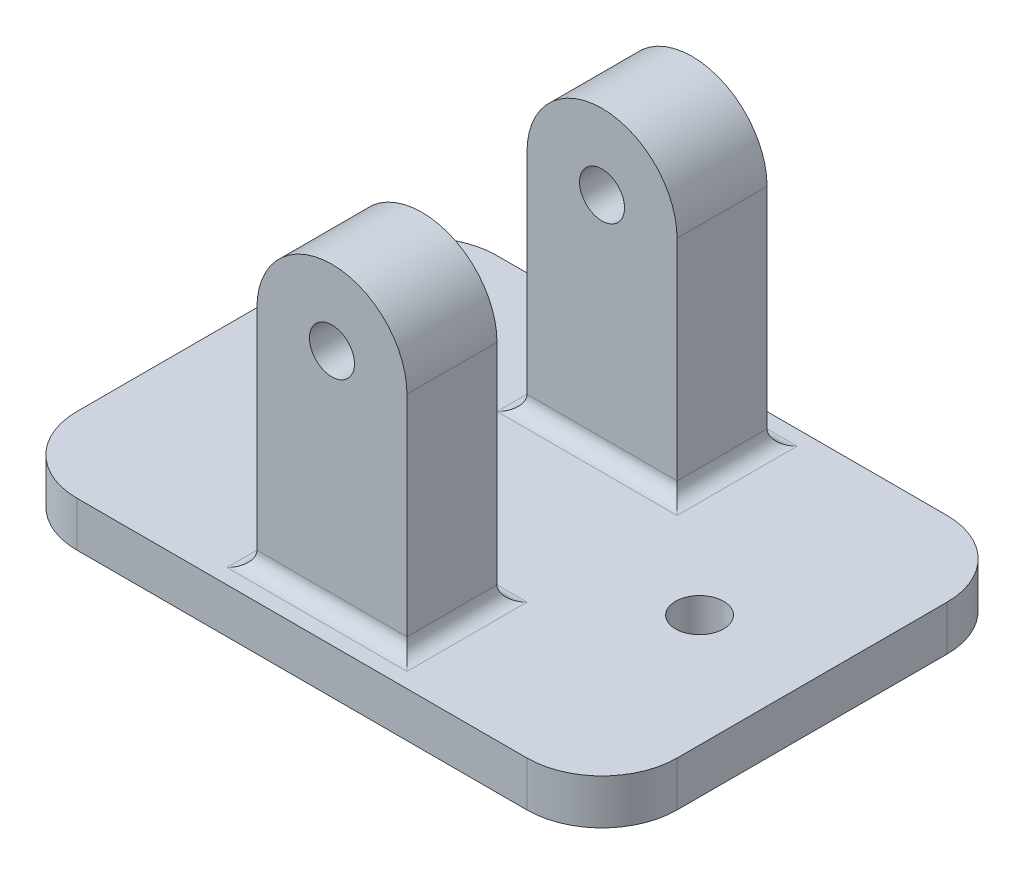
ISO-10303-21;
HEADER;
FILE_DESCRIPTION(('STEP AP214'),'2;1');
FILE_NAME('part.step','',(''),(''),'','','');
FILE_SCHEMA(('AUTOMOTIVE_DESIGN { 1 0 10303 214 1 1 1 1 }'));
ENDSEC;
DATA;
#1=APPLICATION_CONTEXT('core data for automotive mechanical design processes');
#2=APPLICATION_PROTOCOL_DEFINITION('international standard','automotive_design',2000,#1);
#3=PRODUCT_CONTEXT('',#1,'mechanical');
#4=PRODUCT('Part','Part','',(#3));
#5=PRODUCT_RELATED_PRODUCT_CATEGORY('part','',(#4));
#6=PRODUCT_DEFINITION_FORMATION('','',#4);
#7=PRODUCT_DEFINITION_CONTEXT('part definition',#1,'design');
#8=PRODUCT_DEFINITION('design','',#6,#7);
#9=PRODUCT_DEFINITION_SHAPE('','',#8);
#10=(LENGTH_UNIT() NAMED_UNIT(*) SI_UNIT(.MILLI.,.METRE.));
#11=(NAMED_UNIT(*) PLANE_ANGLE_UNIT() SI_UNIT($,.RADIAN.));
#12=(NAMED_UNIT(*) SI_UNIT($,.STERADIAN.) SOLID_ANGLE_UNIT());
#13=UNCERTAINTY_MEASURE_WITH_UNIT(LENGTH_MEASURE(1.E-05),#10,'distance_accuracy_value','');
#14=(GEOMETRIC_REPRESENTATION_CONTEXT(3) GLOBAL_UNCERTAINTY_ASSIGNED_CONTEXT((#13)) GLOBAL_UNIT_ASSIGNED_CONTEXT((#10,
#11,#12)) REPRESENTATION_CONTEXT('',''));
#15=CARTESIAN_POINT('',(0.,0.,0.));
#16=DIRECTION('',(0.,0.,1.));
#17=DIRECTION('',(1.,0.,0.));
#18=AXIS2_PLACEMENT_3D('',#15,#16,#17);
#19=CARTESIAN_POINT('',(5.,0.,-12.));
#20=DIRECTION('',(-1.,0.,0.));
#21=DIRECTION('',(0.,-1.,0.));
#22=AXIS2_PLACEMENT_3D('',#19,#20,#21);
#23=PLANE('',#22);
#24=DIRECTION('',(0.,1.,0.));
#25=VECTOR('',#24,1.);
#26=CARTESIAN_POINT('',(5.,0.,-6.));
#27=LINE('',#26,#25);
#28=CARTESIAN_POINT('',(5.,-14.,-6.));
#29=VERTEX_POINT('',#28);
#30=CARTESIAN_POINT('',(5.,0.,-6.));
#31=VERTEX_POINT('',#30);
#32=EDGE_CURVE('E184',#29,#31,#27,.T.);
#33=ORIENTED_EDGE('',*,*,#32,.F.);
#34=DIRECTION('',(0.,0.,1.));
#35=VECTOR('',#34,1.);
#36=CARTESIAN_POINT('',(5.,-14.,-12.));
#37=LINE('',#36,#35);
#38=CARTESIAN_POINT('',(5.,-14.,-12.));
#39=VERTEX_POINT('',#38);
#40=EDGE_CURVE('E262',#29,#39,#37,.F.);
#41=ORIENTED_EDGE('',*,*,#40,.T.);
#42=DIRECTION('',(0.,-1.,0.));
#43=VECTOR('',#42,1.);
#44=CARTESIAN_POINT('',(5.,0.,-12.));
#45=LINE('',#44,#43);
#46=CARTESIAN_POINT('',(5.,0.,-12.));
#47=VERTEX_POINT('',#46);
#48=EDGE_CURVE('E385',#47,#39,#45,.T.);
#49=ORIENTED_EDGE('',*,*,#48,.F.);
#50=DIRECTION('',(0.,0.,1.));
#51=VECTOR('',#50,1.);
#52=CARTESIAN_POINT('',(5.,0.,-12.));
#53=LINE('',#52,#51);
#54=EDGE_CURVE('E207',#47,#31,#53,.T.);
#55=ORIENTED_EDGE('',*,*,#54,.T.);
#56=EDGE_LOOP('',(#33,#41,#49,#55));
#57=FACE_BOUND('',#56,.T.);
#58=ADVANCED_FACE('F38',(#57),#23,.F.);
#59=CARTESIAN_POINT('',(-5.,0.,-12.));
#60=DIRECTION('',(-1.,0.,0.));
#61=DIRECTION('',(0.,0.,1.));
#62=AXIS2_PLACEMENT_3D('',#59,#60,#61);
#63=PLANE('',#62);
#64=DIRECTION('',(0.,-1.,0.));
#65=VECTOR('',#64,1.);
#66=CARTESIAN_POINT('',(-5.,0.,-12.));
#67=LINE('',#66,#65);
#68=CARTESIAN_POINT('',(-5.,0.,-12.));
#69=VERTEX_POINT('',#68);
#70=CARTESIAN_POINT('',(-5.,-14.,-12.));
#71=VERTEX_POINT('',#70);
#72=EDGE_CURVE('E388',#69,#71,#67,.T.);
#73=ORIENTED_EDGE('',*,*,#72,.T.);
#74=DIRECTION('',(0.,0.,1.));
#75=VECTOR('',#74,1.);
#76=CARTESIAN_POINT('',(-5.,-14.,-6.));
#77=LINE('',#76,#75);
#78=CARTESIAN_POINT('',(-5.,-14.,-6.));
#79=VERTEX_POINT('',#78);
#80=EDGE_CURVE('E196',#71,#79,#77,.T.);
#81=ORIENTED_EDGE('',*,*,#80,.T.);
#82=DIRECTION('',(0.,-1.,0.));
#83=VECTOR('',#82,1.);
#84=CARTESIAN_POINT('',(-5.,0.,-6.));
#85=LINE('',#84,#83);
#86=CARTESIAN_POINT('',(-5.,0.,-6.));
#87=VERTEX_POINT('',#86);
#88=EDGE_CURVE('E181',#87,#79,#85,.T.);
#89=ORIENTED_EDGE('',*,*,#88,.F.);
#90=DIRECTION('',(0.,0.,1.));
#91=VECTOR('',#90,1.);
#92=CARTESIAN_POINT('',(-5.,0.,-12.));
#93=LINE('',#92,#91);
#94=EDGE_CURVE('E193',#69,#87,#93,.T.);
#95=ORIENTED_EDGE('',*,*,#94,.F.);
#96=EDGE_LOOP('',(#73,#81,#89,#95));
#97=FACE_BOUND('',#96,.T.);
#98=ADVANCED_FACE('F192',(#97),#63,.T.);
#99=CARTESIAN_POINT('',(0.,0.,-12.));
#100=DIRECTION('',(0.,0.,1.));
#101=DIRECTION('',(1.,0.,0.));
#102=AXIS2_PLACEMENT_3D('',#99,#100,#101);
#103=CYLINDRICAL_SURFACE('',#102,5.);
#104=ORIENTED_EDGE('',*,*,#94,.T.);
#105=CARTESIAN_POINT('',(0.,0.,-6.));
#106=DIRECTION('',(0.,0.,1.));
#107=DIRECTION('',(1.,0.,0.));
#108=AXIS2_PLACEMENT_3D('',#105,#106,#107);
#109=CIRCLE('',#108,5.);
#110=EDGE_CURVE('E178',#31,#87,#109,.T.);
#111=ORIENTED_EDGE('',*,*,#110,.F.);
#112=ORIENTED_EDGE('',*,*,#54,.F.);
#113=CARTESIAN_POINT('',(0.,0.,-12.));
#114=DIRECTION('',(0.,0.,1.));
#115=DIRECTION('',(1.,0.,0.));
#116=AXIS2_PLACEMENT_3D('',#113,#114,#115);
#117=CIRCLE('',#116,5.);
#118=EDGE_CURVE('E201',#47,#69,#117,.T.);
#119=ORIENTED_EDGE('',*,*,#118,.T.);
#120=EDGE_LOOP('',(#104,#111,#112,#119));
#121=FACE_BOUND('',#120,.T.);
#122=ADVANCED_FACE('F199',(#121),#103,.T.);
#123=CARTESIAN_POINT('',(0.,0.,-12.));
#124=DIRECTION('',(0.,0.,1.));
#125=DIRECTION('',(1.,0.,0.));
#126=AXIS2_PLACEMENT_3D('',#123,#124,#125);
#127=CYLINDRICAL_SURFACE('',#126,1.5);
#128=CARTESIAN_POINT('',(0.,0.,-12.));
#129=DIRECTION('',(0.,0.,1.));
#130=DIRECTION('',(1.,0.,0.));
#131=AXIS2_PLACEMENT_3D('',#128,#129,#130);
#132=CIRCLE('',#131,1.5);
#133=CARTESIAN_POINT('',(1.5,0.,-12.));
#134=VERTEX_POINT('',#133);
#135=EDGE_CURVE('E376',#134,#134,#132,.T.);
#136=ORIENTED_EDGE('',*,*,#135,.F.);
#137=EDGE_LOOP('',(#136));
#138=FACE_BOUND('',#137,.T.);
#139=CARTESIAN_POINT('',(0.,0.,-6.));
#140=DIRECTION('',(0.,0.,1.));
#141=DIRECTION('',(1.,0.,0.));
#142=AXIS2_PLACEMENT_3D('',#139,#140,#141);
#143=CIRCLE('',#142,1.5);
#144=CARTESIAN_POINT('',(1.5,0.,-6.));
#145=VERTEX_POINT('',#144);
#146=EDGE_CURVE('E188',#145,#145,#143,.T.);
#147=ORIENTED_EDGE('',*,*,#146,.T.);
#148=EDGE_LOOP('',(#147));
#149=FACE_BOUND('',#148,.T.);
#150=ADVANCED_FACE('F430',(#138,#149),#127,.F.);
#151=DIRECTION('',(0.,-1.,0.));
#152=VECTOR('',#151,1.);
#153=CARTESIAN_POINT('',(5.,0.,12.));
#154=LINE('',#153,#152);
#155=CARTESIAN_POINT('',(5.,0.,12.));
#156=VERTEX_POINT('',#155);
#157=CARTESIAN_POINT('',(5.,-14.,12.));
#158=VERTEX_POINT('',#157);
#159=EDGE_CURVE('E309',#156,#158,#154,.T.);
#160=ORIENTED_EDGE('',*,*,#159,.T.);
#161=DIRECTION('',(0.,0.,1.));
#162=VECTOR('',#161,1.);
#163=CARTESIAN_POINT('',(5.,-14.,-12.));
#164=LINE('',#163,#162);
#165=CARTESIAN_POINT('',(5.,-14.,6.));
#166=VERTEX_POINT('',#165);
#167=EDGE_CURVE('E47',#158,#166,#164,.F.);
#168=ORIENTED_EDGE('',*,*,#167,.T.);
#169=DIRECTION('',(0.,1.,0.));
#170=VECTOR('',#169,1.);
#171=CARTESIAN_POINT('',(5.,0.,6.));
#172=LINE('',#171,#170);
#173=CARTESIAN_POINT('',(5.,0.,6.));
#174=VERTEX_POINT('',#173);
#175=EDGE_CURVE('E307',#166,#174,#172,.T.);
#176=ORIENTED_EDGE('',*,*,#175,.T.);
#177=EDGE_CURVE('E389',#174,#156,#53,.T.);
#178=ORIENTED_EDGE('',*,*,#177,.T.);
#179=EDGE_LOOP('',(#160,#168,#176,#178));
#180=FACE_BOUND('',#179,.T.);
#181=ADVANCED_FACE('F306',(#180),#23,.F.);
#182=DIRECTION('',(0.,-1.,0.));
#183=VECTOR('',#182,1.);
#184=CARTESIAN_POINT('',(-5.,0.,6.));
#185=LINE('',#184,#183);
#186=CARTESIAN_POINT('',(-5.,0.,6.));
#187=VERTEX_POINT('',#186);
#188=CARTESIAN_POINT('',(-5.,-14.,6.));
#189=VERTEX_POINT('',#188);
#190=EDGE_CURVE('E318',#187,#189,#185,.T.);
#191=ORIENTED_EDGE('',*,*,#190,.T.);
#192=DIRECTION('',(0.,0.,1.));
#193=VECTOR('',#192,1.);
#194=CARTESIAN_POINT('',(-5.,-14.,12.));
#195=LINE('',#194,#193);
#196=CARTESIAN_POINT('',(-5.,-14.,12.));
#197=VERTEX_POINT('',#196);
#198=EDGE_CURVE('E61',#189,#197,#195,.T.);
#199=ORIENTED_EDGE('',*,*,#198,.T.);
#200=DIRECTION('',(0.,-1.,0.));
#201=VECTOR('',#200,1.);
#202=CARTESIAN_POINT('',(-5.,0.,12.));
#203=LINE('',#202,#201);
#204=CARTESIAN_POINT('',(-5.,0.,12.));
#205=VERTEX_POINT('',#204);
#206=EDGE_CURVE('E380',#205,#197,#203,.T.);
#207=ORIENTED_EDGE('',*,*,#206,.F.);
#208=EDGE_CURVE('E203',#187,#205,#93,.T.);
#209=ORIENTED_EDGE('',*,*,#208,.F.);
#210=EDGE_LOOP('',(#191,#199,#207,#209));
#211=FACE_BOUND('',#210,.T.);
#212=ADVANCED_FACE('F427',(#211),#63,.T.);
#213=CARTESIAN_POINT('',(0.,0.,6.));
#214=DIRECTION('',(0.,0.,1.));
#215=DIRECTION('',(1.,0.,0.));
#216=AXIS2_PLACEMENT_3D('',#213,#214,#215);
#217=CIRCLE('',#216,5.);
#218=EDGE_CURVE('E315',#174,#187,#217,.T.);
#219=ORIENTED_EDGE('',*,*,#218,.T.);
#220=ORIENTED_EDGE('',*,*,#208,.T.);
#221=CARTESIAN_POINT('',(0.,0.,12.));
#222=DIRECTION('',(0.,0.,1.));
#223=DIRECTION('',(1.,0.,0.));
#224=AXIS2_PLACEMENT_3D('',#221,#222,#223);
#225=CIRCLE('',#224,5.);
#226=EDGE_CURVE('E382',#156,#205,#225,.T.);
#227=ORIENTED_EDGE('',*,*,#226,.F.);
#228=ORIENTED_EDGE('',*,*,#177,.F.);
#229=EDGE_LOOP('',(#219,#220,#227,#228));
#230=FACE_BOUND('',#229,.T.);
#231=ADVANCED_FACE('F435',(#230),#103,.T.);
#232=CARTESIAN_POINT('',(0.,0.,-12.));
#233=DIRECTION('',(0.,0.,1.));
#234=DIRECTION('',(1.,0.,0.));
#235=AXIS2_PLACEMENT_3D('',#232,#233,#234);
#236=PLANE('',#235);
#237=ORIENTED_EDGE('',*,*,#135,.T.);
#238=EDGE_LOOP('',(#237));
#239=FACE_BOUND('',#238,.T.);
#240=ORIENTED_EDGE('',*,*,#48,.T.);
#241=DIRECTION('',(1.,0.,0.));
#242=VECTOR('',#241,1.);
#243=CARTESIAN_POINT('',(0.,-14.,-12.));
#244=LINE('',#243,#242);
#245=EDGE_CURVE('E267',#39,#71,#244,.F.);
#246=ORIENTED_EDGE('',*,*,#245,.T.);
#247=ORIENTED_EDGE('',*,*,#72,.F.);
#248=ORIENTED_EDGE('',*,*,#118,.F.);
#249=EDGE_LOOP('',(#240,#246,#247,#248));
#250=FACE_BOUND('',#249,.T.);
#251=ADVANCED_FACE('F395',(#239,#250),#236,.F.);
#252=CARTESIAN_POINT('',(0.,0.,12.));
#253=DIRECTION('',(0.,0.,1.));
#254=DIRECTION('',(1.,0.,0.));
#255=AXIS2_PLACEMENT_3D('',#252,#253,#254);
#256=PLANE('',#255);
#257=CARTESIAN_POINT('',(0.,0.,12.));
#258=DIRECTION('',(0.,0.,1.));
#259=DIRECTION('',(1.,0.,0.));
#260=AXIS2_PLACEMENT_3D('',#257,#258,#259);
#261=CIRCLE('',#260,1.5);
#262=CARTESIAN_POINT('',(1.5,0.,12.));
#263=VERTEX_POINT('',#262);
#264=EDGE_CURVE('E364',#263,#263,#261,.T.);
#265=ORIENTED_EDGE('',*,*,#264,.F.);
#266=EDGE_LOOP('',(#265));
#267=FACE_BOUND('',#266,.T.);
#268=ORIENTED_EDGE('',*,*,#206,.T.);
#269=DIRECTION('',(1.,0.,0.));
#270=VECTOR('',#269,1.);
#271=CARTESIAN_POINT('',(5.,-14.,12.));
#272=LINE('',#271,#270);
#273=EDGE_CURVE('E11',#197,#158,#272,.T.);
#274=ORIENTED_EDGE('',*,*,#273,.T.);
#275=ORIENTED_EDGE('',*,*,#159,.F.);
#276=ORIENTED_EDGE('',*,*,#226,.T.);
#277=EDGE_LOOP('',(#268,#274,#275,#276));
#278=FACE_BOUND('',#277,.T.);
#279=ADVANCED_FACE('F448',(#267,#278),#256,.T.);
#280=CARTESIAN_POINT('',(0.,0.,6.));
#281=DIRECTION('',(0.,0.,1.));
#282=DIRECTION('',(1.,0.,0.));
#283=AXIS2_PLACEMENT_3D('',#280,#281,#282);
#284=CIRCLE('',#283,1.5);
#285=CARTESIAN_POINT('',(1.5,0.,6.));
#286=VERTEX_POINT('',#285);
#287=EDGE_CURVE('E460',#286,#286,#284,.T.);
#288=ORIENTED_EDGE('',*,*,#287,.F.);
#289=EDGE_LOOP('',(#288));
#290=FACE_BOUND('',#289,.T.);
#291=ORIENTED_EDGE('',*,*,#264,.T.);
#292=EDGE_LOOP('',(#291));
#293=FACE_BOUND('',#292,.T.);
#294=ADVANCED_FACE('F438',(#290,#293),#127,.F.);
#295=CARTESIAN_POINT('',(0.,-18.,0.));
#296=DIRECTION('',(0.,1.,0.));
#297=DIRECTION('',(0.,0.,1.));
#298=AXIS2_PLACEMENT_3D('',#295,#296,#297);
#299=PLANE('',#298);
#300=DIRECTION('',(0.,0.,-1.));
#301=VECTOR('',#300,1.);
#302=CARTESIAN_POINT('',(-20.,-18.,-14.));
#303=LINE('',#302,#301);
#304=CARTESIAN_POINT('',(-20.,-18.,9.));
#305=VERTEX_POINT('',#304);
#306=CARTESIAN_POINT('',(-20.,-18.,-9.));
#307=VERTEX_POINT('',#306);
#308=EDGE_CURVE('E358',#305,#307,#303,.T.);
#309=ORIENTED_EDGE('',*,*,#308,.T.);
#310=CARTESIAN_POINT('',(-15.,-18.,-9.));
#311=DIRECTION('',(0.,1.,0.));
#312=DIRECTION('',(0.,0.,1.));
#313=AXIS2_PLACEMENT_3D('',#310,#311,#312);
#314=CIRCLE('',#313,5.);
#315=CARTESIAN_POINT('',(-15.,-18.,-14.));
#316=VERTEX_POINT('',#315);
#317=EDGE_CURVE('E232',#307,#316,#314,.F.);
#318=ORIENTED_EDGE('',*,*,#317,.T.);
#319=DIRECTION('',(1.,0.,0.));
#320=VECTOR('',#319,1.);
#321=CARTESIAN_POINT('',(-20.,-18.,-14.));
#322=LINE('',#321,#320);
#323=CARTESIAN_POINT('',(15.,-18.,-14.));
#324=VERTEX_POINT('',#323);
#325=EDGE_CURVE('E361',#316,#324,#322,.T.);
#326=ORIENTED_EDGE('',*,*,#325,.T.);
#327=CARTESIAN_POINT('',(15.,-18.,-9.));
#328=DIRECTION('',(0.,1.,0.));
#329=DIRECTION('',(0.,0.,1.));
#330=AXIS2_PLACEMENT_3D('',#327,#328,#329);
#331=CIRCLE('',#330,5.);
#332=CARTESIAN_POINT('',(20.,-18.,-9.));
#333=VERTEX_POINT('',#332);
#334=EDGE_CURVE('E228',#324,#333,#331,.F.);
#335=ORIENTED_EDGE('',*,*,#334,.T.);
#336=DIRECTION('',(0.,0.,1.));
#337=VECTOR('',#336,1.);
#338=CARTESIAN_POINT('',(20.,-18.,-14.));
#339=LINE('',#338,#337);
#340=CARTESIAN_POINT('',(20.,-18.,9.));
#341=VERTEX_POINT('',#340);
#342=EDGE_CURVE('E352',#333,#341,#339,.T.);
#343=ORIENTED_EDGE('',*,*,#342,.T.);
#344=CARTESIAN_POINT('',(15.,-18.,9.));
#345=DIRECTION('',(0.,1.,0.));
#346=DIRECTION('',(0.,0.,1.));
#347=AXIS2_PLACEMENT_3D('',#344,#345,#346);
#348=CIRCLE('',#347,5.);
#349=CARTESIAN_POINT('',(15.,-18.,14.));
#350=VERTEX_POINT('',#349);
#351=EDGE_CURVE('E226',#341,#350,#348,.F.);
#352=ORIENTED_EDGE('',*,*,#351,.T.);
#353=DIRECTION('',(-1.,0.,0.));
#354=VECTOR('',#353,1.);
#355=CARTESIAN_POINT('',(-20.,-18.,14.));
#356=LINE('',#355,#354);
#357=CARTESIAN_POINT('',(-15.,-18.,14.));
#358=VERTEX_POINT('',#357);
#359=EDGE_CURVE('E355',#350,#358,#356,.T.);
#360=ORIENTED_EDGE('',*,*,#359,.T.);
#361=CARTESIAN_POINT('',(-15.,-18.,9.));
#362=DIRECTION('',(0.,1.,0.));
#363=DIRECTION('',(0.,0.,1.));
#364=AXIS2_PLACEMENT_3D('',#361,#362,#363);
#365=CIRCLE('',#364,5.);
#366=EDGE_CURVE('E230',#358,#305,#365,.F.);
#367=ORIENTED_EDGE('',*,*,#366,.T.);
#368=EDGE_LOOP('',(#309,#318,#326,#335,#343,#352,#360,#367));
#369=FACE_BOUND('',#368,.T.);
#370=CARTESIAN_POINT('',(-12.5,-18.,0.));
#371=DIRECTION('',(0.,-1.,0.));
#372=DIRECTION('',(0.,0.,-1.));
#373=AXIS2_PLACEMENT_3D('',#370,#371,#372);
#374=CIRCLE('',#373,1.6);
#375=CARTESIAN_POINT('',(-12.5,-18.,-1.6));
#376=VERTEX_POINT('',#375);
#377=EDGE_CURVE('E347',#376,#376,#374,.T.);
#378=ORIENTED_EDGE('',*,*,#377,.F.);
#379=EDGE_LOOP('',(#378));
#380=FACE_BOUND('',#379,.T.);
#381=CARTESIAN_POINT('',(12.5,-18.,0.));
#382=DIRECTION('',(0.,-1.,0.));
#383=DIRECTION('',(0.,0.,-1.));
#384=AXIS2_PLACEMENT_3D('',#381,#382,#383);
#385=CIRCLE('',#384,1.6);
#386=CARTESIAN_POINT('',(12.5,-18.,-1.6));
#387=VERTEX_POINT('',#386);
#388=EDGE_CURVE('E342',#387,#387,#385,.T.);
#389=ORIENTED_EDGE('',*,*,#388,.F.);
#390=EDGE_LOOP('',(#389));
#391=FACE_BOUND('',#390,.T.);
#392=ADVANCED_FACE('F328',(#369,#380,#391),#299,.F.);
#393=CARTESIAN_POINT('',(0.,-15.,0.));
#394=DIRECTION('',(0.,1.,0.));
#395=DIRECTION('',(0.,0.,1.));
#396=AXIS2_PLACEMENT_3D('',#393,#394,#395);
#397=PLANE('',#396);
#398=DIRECTION('',(1.,0.,0.));
#399=VECTOR('',#398,1.);
#400=CARTESIAN_POINT('',(0.,-15.,-13.));
#401=LINE('',#400,#399);
#402=CARTESIAN_POINT('',(-6.,-15.,-13.));
#403=VERTEX_POINT('',#402);
#404=CARTESIAN_POINT('',(6.,-15.,-13.));
#405=VERTEX_POINT('',#404);
#406=EDGE_CURVE('E255',#403,#405,#401,.T.);
#407=ORIENTED_EDGE('',*,*,#406,.T.);
#408=DIRECTION('',(0.,0.,1.));
#409=VECTOR('',#408,1.);
#410=CARTESIAN_POINT('',(6.,-15.,0.));
#411=LINE('',#410,#409);
#412=CARTESIAN_POINT('',(6.,-15.,-5.));
#413=VERTEX_POINT('',#412);
#414=EDGE_CURVE('E259',#405,#413,#411,.T.);
#415=ORIENTED_EDGE('',*,*,#414,.T.);
#416=DIRECTION('',(1.,0.,0.));
#417=VECTOR('',#416,1.);
#418=CARTESIAN_POINT('',(-5.,-15.,-5.));
#419=LINE('',#418,#417);
#420=CARTESIAN_POINT('',(-6.,-15.,-5.));
#421=VERTEX_POINT('',#420);
#422=EDGE_CURVE('E257',#413,#421,#419,.F.);
#423=ORIENTED_EDGE('',*,*,#422,.T.);
#424=DIRECTION('',(0.,0.,1.));
#425=VECTOR('',#424,1.);
#426=CARTESIAN_POINT('',(-6.,-15.,-12.));
#427=LINE('',#426,#425);
#428=EDGE_CURVE('E253',#421,#403,#427,.F.);
#429=ORIENTED_EDGE('',*,*,#428,.T.);
#430=EDGE_LOOP('',(#407,#415,#423,#429));
#431=FACE_BOUND('',#430,.T.);
#432=DIRECTION('',(0.,0.,1.));
#433=VECTOR('',#432,1.);
#434=CARTESIAN_POINT('',(-6.,-15.,6.00000000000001));
#435=LINE('',#434,#433);
#436=CARTESIAN_POINT('',(-6.,-15.,13.));
#437=VERTEX_POINT('',#436);
#438=CARTESIAN_POINT('',(-6.,-15.,5.));
#439=VERTEX_POINT('',#438);
#440=EDGE_CURVE('E248',#437,#439,#435,.F.);
#441=ORIENTED_EDGE('',*,*,#440,.T.);
#442=DIRECTION('',(1.,0.,0.));
#443=VECTOR('',#442,1.);
#444=CARTESIAN_POINT('',(0.,-15.,5.));
#445=LINE('',#444,#443);
#446=CARTESIAN_POINT('',(6.,-15.,5.));
#447=VERTEX_POINT('',#446);
#448=EDGE_CURVE('E250',#439,#447,#445,.T.);
#449=ORIENTED_EDGE('',*,*,#448,.T.);
#450=DIRECTION('',(0.,0.,1.));
#451=VECTOR('',#450,1.);
#452=CARTESIAN_POINT('',(6.,-15.,0.));
#453=LINE('',#452,#451);
#454=CARTESIAN_POINT('',(6.,-15.,13.));
#455=VERTEX_POINT('',#454);
#456=EDGE_CURVE('E246',#447,#455,#453,.T.);
#457=ORIENTED_EDGE('',*,*,#456,.T.);
#458=DIRECTION('',(1.,0.,0.));
#459=VECTOR('',#458,1.);
#460=CARTESIAN_POINT('',(-5.,-15.,13.));
#461=LINE('',#460,#459);
#462=EDGE_CURVE('E244',#455,#437,#461,.F.);
#463=ORIENTED_EDGE('',*,*,#462,.T.);
#464=EDGE_LOOP('',(#441,#449,#457,#463));
#465=FACE_BOUND('',#464,.T.);
#466=CARTESIAN_POINT('',(-12.5,-15.,0.));
#467=DIRECTION('',(0.,-1.,0.));
#468=DIRECTION('',(0.,0.,-1.));
#469=AXIS2_PLACEMENT_3D('',#466,#467,#468);
#470=CIRCLE('',#469,1.6);
#471=CARTESIAN_POINT('',(-12.5,-15.,-1.6));
#472=VERTEX_POINT('',#471);
#473=EDGE_CURVE('E334',#472,#472,#470,.T.);
#474=ORIENTED_EDGE('',*,*,#473,.T.);
#475=EDGE_LOOP('',(#474));
#476=FACE_BOUND('',#475,.T.);
#477=DIRECTION('',(1.,0.,0.));
#478=VECTOR('',#477,1.);
#479=CARTESIAN_POINT('',(-20.,-15.,-14.));
#480=LINE('',#479,#478);
#481=CARTESIAN_POINT('',(-15.,-15.,-14.));
#482=VERTEX_POINT('',#481);
#483=CARTESIAN_POINT('',(15.,-15.,-14.));
#484=VERTEX_POINT('',#483);
#485=EDGE_CURVE('E338',#482,#484,#480,.T.);
#486=ORIENTED_EDGE('',*,*,#485,.F.);
#487=CARTESIAN_POINT('',(-15.,-15.,-9.));
#488=DIRECTION('',(0.,1.,0.));
#489=DIRECTION('',(0.,0.,1.));
#490=AXIS2_PLACEMENT_3D('',#487,#488,#489);
#491=CIRCLE('',#490,5.);
#492=CARTESIAN_POINT('',(-20.,-15.,-9.));
#493=VERTEX_POINT('',#492);
#494=EDGE_CURVE('E219',#482,#493,#491,.T.);
#495=ORIENTED_EDGE('',*,*,#494,.T.);
#496=DIRECTION('',(0.,0.,-1.));
#497=VECTOR('',#496,1.);
#498=CARTESIAN_POINT('',(-20.,-15.,-14.));
#499=LINE('',#498,#497);
#500=CARTESIAN_POINT('',(-20.,-15.,9.));
#501=VERTEX_POINT('',#500);
#502=EDGE_CURVE('E370',#501,#493,#499,.T.);
#503=ORIENTED_EDGE('',*,*,#502,.F.);
#504=CARTESIAN_POINT('',(-15.,-15.,9.));
#505=DIRECTION('',(0.,1.,0.));
#506=DIRECTION('',(0.,0.,1.));
#507=AXIS2_PLACEMENT_3D('',#504,#505,#506);
#508=CIRCLE('',#507,5.);
#509=CARTESIAN_POINT('',(-15.,-15.,14.));
#510=VERTEX_POINT('',#509);
#511=EDGE_CURVE('E217',#501,#510,#508,.T.);
#512=ORIENTED_EDGE('',*,*,#511,.T.);
#513=DIRECTION('',(-1.,0.,0.));
#514=VECTOR('',#513,1.);
#515=CARTESIAN_POINT('',(-20.,-15.,14.));
#516=LINE('',#515,#514);
#517=CARTESIAN_POINT('',(15.,-15.,14.));
#518=VERTEX_POINT('',#517);
#519=EDGE_CURVE('E367',#518,#510,#516,.T.);
#520=ORIENTED_EDGE('',*,*,#519,.F.);
#521=CARTESIAN_POINT('',(15.,-15.,9.));
#522=DIRECTION('',(0.,1.,0.));
#523=DIRECTION('',(0.,0.,1.));
#524=AXIS2_PLACEMENT_3D('',#521,#522,#523);
#525=CIRCLE('',#524,5.);
#526=CARTESIAN_POINT('',(20.,-15.,9.));
#527=VERTEX_POINT('',#526);
#528=EDGE_CURVE('E213',#518,#527,#525,.T.);
#529=ORIENTED_EDGE('',*,*,#528,.T.);
#530=DIRECTION('',(0.,0.,1.));
#531=VECTOR('',#530,1.);
#532=CARTESIAN_POINT('',(20.,-15.,-14.));
#533=LINE('',#532,#531);
#534=CARTESIAN_POINT('',(20.,-15.,-9.));
#535=VERTEX_POINT('',#534);
#536=EDGE_CURVE('E350',#535,#527,#533,.T.);
#537=ORIENTED_EDGE('',*,*,#536,.F.);
#538=CARTESIAN_POINT('',(15.,-15.,-9.));
#539=DIRECTION('',(0.,1.,0.));
#540=DIRECTION('',(0.,0.,1.));
#541=AXIS2_PLACEMENT_3D('',#538,#539,#540);
#542=CIRCLE('',#541,5.);
#543=EDGE_CURVE('E215',#535,#484,#542,.T.);
#544=ORIENTED_EDGE('',*,*,#543,.T.);
#545=EDGE_LOOP('',(#486,#495,#503,#512,#520,#529,#537,#544));
#546=FACE_BOUND('',#545,.T.);
#547=CARTESIAN_POINT('',(12.5,-15.,0.));
#548=DIRECTION('',(0.,-1.,0.));
#549=DIRECTION('',(0.,0.,-1.));
#550=AXIS2_PLACEMENT_3D('',#547,#548,#549);
#551=CIRCLE('',#550,1.6);
#552=CARTESIAN_POINT('',(12.5,-15.,-1.6));
#553=VERTEX_POINT('',#552);
#554=EDGE_CURVE('E317',#553,#553,#551,.T.);
#555=ORIENTED_EDGE('',*,*,#554,.T.);
#556=EDGE_LOOP('',(#555));
#557=FACE_BOUND('',#556,.T.);
#558=ADVANCED_FACE('F324',(#431,#465,#476,#546,#557),#397,.T.);
#559=CARTESIAN_POINT('',(20.,-18.,-14.));
#560=DIRECTION('',(-1.,0.,0.));
#561=DIRECTION('',(0.,0.,1.));
#562=AXIS2_PLACEMENT_3D('',#559,#560,#561);
#563=PLANE('',#562);
#564=ORIENTED_EDGE('',*,*,#342,.F.);
#565=DIRECTION('',(0.,1.,0.));
#566=VECTOR('',#565,1.);
#567=CARTESIAN_POINT('',(20.,-18.,-9.));
#568=LINE('',#567,#566);
#569=EDGE_CURVE('E241',#333,#535,#568,.T.);
#570=ORIENTED_EDGE('',*,*,#569,.T.);
#571=ORIENTED_EDGE('',*,*,#536,.T.);
#572=DIRECTION('',(0.,1.,0.));
#573=VECTOR('',#572,1.);
#574=CARTESIAN_POINT('',(20.,-18.,9.));
#575=LINE('',#574,#573);
#576=EDGE_CURVE('E239',#527,#341,#575,.F.);
#577=ORIENTED_EDGE('',*,*,#576,.T.);
#578=EDGE_LOOP('',(#564,#570,#571,#577));
#579=FACE_BOUND('',#578,.T.);
#580=ADVANCED_FACE('F327',(#579),#563,.F.);
#581=CARTESIAN_POINT('',(-20.,-18.,14.));
#582=DIRECTION('',(0.,0.,-1.));
#583=DIRECTION('',(-1.,0.,0.));
#584=AXIS2_PLACEMENT_3D('',#581,#582,#583);
#585=PLANE('',#584);
#586=ORIENTED_EDGE('',*,*,#519,.T.);
#587=DIRECTION('',(0.,1.,0.));
#588=VECTOR('',#587,1.);
#589=CARTESIAN_POINT('',(-15.,-18.,14.));
#590=LINE('',#589,#588);
#591=EDGE_CURVE('E237',#510,#358,#590,.F.);
#592=ORIENTED_EDGE('',*,*,#591,.T.);
#593=ORIENTED_EDGE('',*,*,#359,.F.);
#594=DIRECTION('',(0.,1.,0.));
#595=VECTOR('',#594,1.);
#596=CARTESIAN_POINT('',(15.,-18.,14.));
#597=LINE('',#596,#595);
#598=EDGE_CURVE('E234',#350,#518,#597,.T.);
#599=ORIENTED_EDGE('',*,*,#598,.T.);
#600=EDGE_LOOP('',(#586,#592,#593,#599));
#601=FACE_BOUND('',#600,.T.);
#602=ADVANCED_FACE('F498',(#601),#585,.F.);
#603=CARTESIAN_POINT('',(-20.,-18.,-14.));
#604=DIRECTION('',(1.,0.,0.));
#605=DIRECTION('',(0.,0.,-1.));
#606=AXIS2_PLACEMENT_3D('',#603,#604,#605);
#607=PLANE('',#606);
#608=ORIENTED_EDGE('',*,*,#502,.T.);
#609=DIRECTION('',(0.,1.,0.));
#610=VECTOR('',#609,1.);
#611=CARTESIAN_POINT('',(-20.,-18.,-9.));
#612=LINE('',#611,#610);
#613=EDGE_CURVE('E224',#493,#307,#612,.F.);
#614=ORIENTED_EDGE('',*,*,#613,.T.);
#615=ORIENTED_EDGE('',*,*,#308,.F.);
#616=DIRECTION('',(0.,1.,0.));
#617=VECTOR('',#616,1.);
#618=CARTESIAN_POINT('',(-20.,-18.,9.));
#619=LINE('',#618,#617);
#620=EDGE_CURVE('E221',#305,#501,#619,.T.);
#621=ORIENTED_EDGE('',*,*,#620,.T.);
#622=EDGE_LOOP('',(#608,#614,#615,#621));
#623=FACE_BOUND('',#622,.T.);
#624=ADVANCED_FACE('F494',(#623),#607,.F.);
#625=CARTESIAN_POINT('',(-20.,-18.,-14.));
#626=DIRECTION('',(0.,0.,1.));
#627=DIRECTION('',(1.,0.,0.));
#628=AXIS2_PLACEMENT_3D('',#625,#626,#627);
#629=PLANE('',#628);
#630=ORIENTED_EDGE('',*,*,#325,.F.);
#631=DIRECTION('',(0.,1.,0.));
#632=VECTOR('',#631,1.);
#633=CARTESIAN_POINT('',(-15.,-18.,-14.));
#634=LINE('',#633,#632);
#635=EDGE_CURVE('E205',#316,#482,#634,.T.);
#636=ORIENTED_EDGE('',*,*,#635,.T.);
#637=ORIENTED_EDGE('',*,*,#485,.T.);
#638=DIRECTION('',(0.,1.,0.));
#639=VECTOR('',#638,1.);
#640=CARTESIAN_POINT('',(15.,-18.,-14.));
#641=LINE('',#640,#639);
#642=EDGE_CURVE('E202',#484,#324,#641,.F.);
#643=ORIENTED_EDGE('',*,*,#642,.T.);
#644=EDGE_LOOP('',(#630,#636,#637,#643));
#645=FACE_BOUND('',#644,.T.);
#646=ADVANCED_FACE('F489',(#645),#629,.F.);
#647=CARTESIAN_POINT('',(-12.5,-18.,0.));
#648=DIRECTION('',(0.,1.,0.));
#649=DIRECTION('',(0.,0.,1.));
#650=AXIS2_PLACEMENT_3D('',#647,#648,#649);
#651=CYLINDRICAL_SURFACE('',#650,1.6);
#652=ORIENTED_EDGE('',*,*,#377,.T.);
#653=EDGE_LOOP('',(#652));
#654=FACE_BOUND('',#653,.T.);
#655=ORIENTED_EDGE('',*,*,#473,.F.);
#656=EDGE_LOOP('',(#655));
#657=FACE_BOUND('',#656,.T.);
#658=ADVANCED_FACE('F486',(#654,#657),#651,.F.);
#659=CARTESIAN_POINT('',(12.5,-18.,0.));
#660=DIRECTION('',(0.,1.,0.));
#661=DIRECTION('',(0.,0.,1.));
#662=AXIS2_PLACEMENT_3D('',#659,#660,#661);
#663=CYLINDRICAL_SURFACE('',#662,1.6);
#664=ORIENTED_EDGE('',*,*,#388,.T.);
#665=EDGE_LOOP('',(#664));
#666=FACE_BOUND('',#665,.T.);
#667=ORIENTED_EDGE('',*,*,#554,.F.);
#668=EDGE_LOOP('',(#667));
#669=FACE_BOUND('',#668,.T.);
#670=ADVANCED_FACE('F481',(#666,#669),#663,.F.);
#671=CARTESIAN_POINT('',(0.,0.,6.));
#672=DIRECTION('',(0.,0.,1.));
#673=DIRECTION('',(1.,0.,0.));
#674=AXIS2_PLACEMENT_3D('',#671,#672,#673);
#675=PLANE('',#674);
#676=ORIENTED_EDGE('',*,*,#175,.F.);
#677=DIRECTION('',(1.,0.,0.));
#678=VECTOR('',#677,1.);
#679=CARTESIAN_POINT('',(0.,-14.,6.));
#680=LINE('',#679,#678);
#681=EDGE_CURVE('E270',#166,#189,#680,.F.);
#682=ORIENTED_EDGE('',*,*,#681,.T.);
#683=ORIENTED_EDGE('',*,*,#190,.F.);
#684=ORIENTED_EDGE('',*,*,#218,.F.);
#685=EDGE_LOOP('',(#676,#682,#683,#684));
#686=FACE_BOUND('',#685,.T.);
#687=ORIENTED_EDGE('',*,*,#287,.T.);
#688=EDGE_LOOP('',(#687));
#689=FACE_BOUND('',#688,.T.);
#690=ADVANCED_FACE('F312',(#686,#689),#675,.F.);
#691=CARTESIAN_POINT('',(0.,0.,-6.));
#692=DIRECTION('',(0.,0.,1.));
#693=DIRECTION('',(1.,0.,0.));
#694=AXIS2_PLACEMENT_3D('',#691,#692,#693);
#695=PLANE('',#694);
#696=ORIENTED_EDGE('',*,*,#146,.F.);
#697=EDGE_LOOP('',(#696));
#698=FACE_BOUND('',#697,.T.);
#699=ORIENTED_EDGE('',*,*,#88,.T.);
#700=DIRECTION('',(1.,0.,0.));
#701=VECTOR('',#700,1.);
#702=CARTESIAN_POINT('',(5.,-14.,-6.));
#703=LINE('',#702,#701);
#704=EDGE_CURVE('E265',#79,#29,#703,.T.);
#705=ORIENTED_EDGE('',*,*,#704,.T.);
#706=ORIENTED_EDGE('',*,*,#32,.T.);
#707=ORIENTED_EDGE('',*,*,#110,.T.);
#708=EDGE_LOOP('',(#699,#705,#706,#707));
#709=FACE_BOUND('',#708,.T.);
#710=ADVANCED_FACE('F180',(#698,#709),#695,.T.);
#711=CARTESIAN_POINT('',(-15.,-18.,-9.));
#712=DIRECTION('',(0.,1.,0.));
#713=DIRECTION('',(0.,0.,1.));
#714=AXIS2_PLACEMENT_3D('',#711,#712,#713);
#715=CYLINDRICAL_SURFACE('',#714,5.);
#716=ORIENTED_EDGE('',*,*,#317,.F.);
#717=ORIENTED_EDGE('',*,*,#613,.F.);
#718=ORIENTED_EDGE('',*,*,#494,.F.);
#719=ORIENTED_EDGE('',*,*,#635,.F.);
#720=EDGE_LOOP('',(#716,#717,#718,#719));
#721=FACE_BOUND('',#720,.T.);
#722=ADVANCED_FACE('F473',(#721),#715,.T.);
#723=CARTESIAN_POINT('',(-15.,-18.,9.));
#724=DIRECTION('',(0.,1.,0.));
#725=DIRECTION('',(0.,0.,1.));
#726=AXIS2_PLACEMENT_3D('',#723,#724,#725);
#727=CYLINDRICAL_SURFACE('',#726,5.);
#728=ORIENTED_EDGE('',*,*,#366,.F.);
#729=ORIENTED_EDGE('',*,*,#591,.F.);
#730=ORIENTED_EDGE('',*,*,#511,.F.);
#731=ORIENTED_EDGE('',*,*,#620,.F.);
#732=EDGE_LOOP('',(#728,#729,#730,#731));
#733=FACE_BOUND('',#732,.T.);
#734=ADVANCED_FACE('F479',(#733),#727,.T.);
#735=CARTESIAN_POINT('',(15.,-18.,-9.));
#736=DIRECTION('',(0.,1.,0.));
#737=DIRECTION('',(0.,0.,1.));
#738=AXIS2_PLACEMENT_3D('',#735,#736,#737);
#739=CYLINDRICAL_SURFACE('',#738,5.);
#740=ORIENTED_EDGE('',*,*,#334,.F.);
#741=ORIENTED_EDGE('',*,*,#642,.F.);
#742=ORIENTED_EDGE('',*,*,#543,.F.);
#743=ORIENTED_EDGE('',*,*,#569,.F.);
#744=EDGE_LOOP('',(#740,#741,#742,#743));
#745=FACE_BOUND('',#744,.T.);
#746=ADVANCED_FACE('F513',(#745),#739,.T.);
#747=CARTESIAN_POINT('',(15.,-18.,9.));
#748=DIRECTION('',(0.,1.,0.));
#749=DIRECTION('',(0.,0.,1.));
#750=AXIS2_PLACEMENT_3D('',#747,#748,#749);
#751=CYLINDRICAL_SURFACE('',#750,5.);
#752=ORIENTED_EDGE('',*,*,#351,.F.);
#753=ORIENTED_EDGE('',*,*,#576,.F.);
#754=ORIENTED_EDGE('',*,*,#528,.F.);
#755=ORIENTED_EDGE('',*,*,#598,.F.);
#756=EDGE_LOOP('',(#752,#753,#754,#755));
#757=FACE_BOUND('',#756,.T.);
#758=ADVANCED_FACE('F529',(#757),#751,.T.);
#759=CARTESIAN_POINT('',(-6.,-14.,-12.));
#760=DIRECTION('',(0.,0.,-1.));
#761=DIRECTION('',(-1.,0.,0.));
#762=AXIS2_PLACEMENT_3D('',#759,#760,#761);
#763=CYLINDRICAL_SURFACE('',#762,1.);
#764=CARTESIAN_POINT('',(-6.,-14.,-5.));
#765=DIRECTION('',(-0.707106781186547,0.,-0.707106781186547));
#766=DIRECTION('',(0.707106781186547,0.,-0.707106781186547));
#767=AXIS2_PLACEMENT_3D('',#764,#765,#766);
#768=ELLIPSE('',#767,1.41421356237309,1.);
#769=EDGE_CURVE('E279',#79,#421,#768,.T.);
#770=ORIENTED_EDGE('',*,*,#769,.F.);
#771=ORIENTED_EDGE('',*,*,#80,.F.);
#772=CARTESIAN_POINT('',(-6.,-14.,-13.));
#773=DIRECTION('',(0.707106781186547,0.,-0.707106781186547));
#774=DIRECTION('',(-0.707106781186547,0.,-0.707106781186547));
#775=AXIS2_PLACEMENT_3D('',#772,#773,#774);
#776=ELLIPSE('',#775,1.41421356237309,1.);
#777=EDGE_CURVE('E282',#403,#71,#776,.F.);
#778=ORIENTED_EDGE('',*,*,#777,.F.);
#779=ORIENTED_EDGE('',*,*,#428,.F.);
#780=EDGE_LOOP('',(#770,#771,#778,#779));
#781=FACE_BOUND('',#780,.T.);
#782=ADVANCED_FACE('F399',(#781),#763,.F.);
#783=CARTESIAN_POINT('',(0.,-14.,-13.));
#784=DIRECTION('',(1.,0.,0.));
#785=DIRECTION('',(0.,0.,-1.));
#786=AXIS2_PLACEMENT_3D('',#783,#784,#785);
#787=CYLINDRICAL_SURFACE('',#786,1.);
#788=ORIENTED_EDGE('',*,*,#777,.T.);
#789=ORIENTED_EDGE('',*,*,#245,.F.);
#790=CARTESIAN_POINT('',(6.,-14.,-13.));
#791=DIRECTION('',(0.707106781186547,0.,0.707106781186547));
#792=DIRECTION('',(0.707106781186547,0.,-0.707106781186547));
#793=AXIS2_PLACEMENT_3D('',#790,#791,#792);
#794=ELLIPSE('',#793,1.41421356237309,1.);
#795=EDGE_CURVE('E277',#405,#39,#794,.F.);
#796=ORIENTED_EDGE('',*,*,#795,.F.);
#797=ORIENTED_EDGE('',*,*,#406,.F.);
#798=EDGE_LOOP('',(#788,#789,#796,#797));
#799=FACE_BOUND('',#798,.T.);
#800=ADVANCED_FACE('F404',(#799),#787,.F.);
#801=CARTESIAN_POINT('',(0.,-14.,-5.));
#802=DIRECTION('',(-1.,0.,0.));
#803=DIRECTION('',(0.,0.,1.));
#804=AXIS2_PLACEMENT_3D('',#801,#802,#803);
#805=CYLINDRICAL_SURFACE('',#804,1.);
#806=ORIENTED_EDGE('',*,*,#769,.T.);
#807=ORIENTED_EDGE('',*,*,#422,.F.);
#808=CARTESIAN_POINT('',(6.,-14.,-5.));
#809=DIRECTION('',(-0.707106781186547,0.,0.707106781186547));
#810=DIRECTION('',(-0.707106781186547,0.,-0.707106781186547));
#811=AXIS2_PLACEMENT_3D('',#808,#809,#810);
#812=ELLIPSE('',#811,1.41421356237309,1.);
#813=EDGE_CURVE('E275',#29,#413,#812,.T.);
#814=ORIENTED_EDGE('',*,*,#813,.F.);
#815=ORIENTED_EDGE('',*,*,#704,.F.);
#816=EDGE_LOOP('',(#806,#807,#814,#815));
#817=FACE_BOUND('',#816,.T.);
#818=ADVANCED_FACE('F409',(#817),#805,.F.);
#819=CARTESIAN_POINT('',(6.,-14.,0.));
#820=DIRECTION('',(0.,0.,1.));
#821=DIRECTION('',(1.,0.,0.));
#822=AXIS2_PLACEMENT_3D('',#819,#820,#821);
#823=CYLINDRICAL_SURFACE('',#822,1.);
#824=ORIENTED_EDGE('',*,*,#795,.T.);
#825=ORIENTED_EDGE('',*,*,#40,.F.);
#826=ORIENTED_EDGE('',*,*,#813,.T.);
#827=ORIENTED_EDGE('',*,*,#414,.F.);
#828=EDGE_LOOP('',(#824,#825,#826,#827));
#829=FACE_BOUND('',#828,.T.);
#830=ADVANCED_FACE('F412',(#829),#823,.F.);
#831=CARTESIAN_POINT('',(0.,-14.,13.));
#832=DIRECTION('',(-1.,0.,0.));
#833=DIRECTION('',(0.,0.,1.));
#834=AXIS2_PLACEMENT_3D('',#831,#832,#833);
#835=CYLINDRICAL_SURFACE('',#834,1.);
#836=CARTESIAN_POINT('',(6.,-14.,13.));
#837=DIRECTION('',(-0.707106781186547,0.,0.707106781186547));
#838=DIRECTION('',(-0.707106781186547,0.,-0.707106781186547));
#839=AXIS2_PLACEMENT_3D('',#836,#837,#838);
#840=ELLIPSE('',#839,1.41421356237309,1.);
#841=EDGE_CURVE('E288',#158,#455,#840,.T.);
#842=ORIENTED_EDGE('',*,*,#841,.F.);
#843=ORIENTED_EDGE('',*,*,#273,.F.);
#844=CARTESIAN_POINT('',(-6.,-14.,13.));
#845=DIRECTION('',(-0.707106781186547,0.,-0.707106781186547));
#846=DIRECTION('',(-0.707106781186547,0.,0.707106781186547));
#847=AXIS2_PLACEMENT_3D('',#844,#845,#846);
#848=ELLIPSE('',#847,1.41421356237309,1.);
#849=EDGE_CURVE('E42',#437,#197,#848,.F.);
#850=ORIENTED_EDGE('',*,*,#849,.F.);
#851=ORIENTED_EDGE('',*,*,#462,.F.);
#852=EDGE_LOOP('',(#842,#843,#850,#851));
#853=FACE_BOUND('',#852,.T.);
#854=ADVANCED_FACE('F40',(#853),#835,.F.);
#855=CARTESIAN_POINT('',(-6.,-14.,-12.));
#856=DIRECTION('',(0.,0.,-1.));
#857=DIRECTION('',(-1.,0.,0.));
#858=AXIS2_PLACEMENT_3D('',#855,#856,#857);
#859=CYLINDRICAL_SURFACE('',#858,1.);
#860=ORIENTED_EDGE('',*,*,#849,.T.);
#861=ORIENTED_EDGE('',*,*,#198,.F.);
#862=CARTESIAN_POINT('',(-6.,-14.,5.));
#863=DIRECTION('',(0.707106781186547,0.,-0.707106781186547));
#864=DIRECTION('',(-0.707106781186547,0.,-0.707106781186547));
#865=AXIS2_PLACEMENT_3D('',#862,#863,#864);
#866=ELLIPSE('',#865,1.41421356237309,1.);
#867=EDGE_CURVE('E287',#439,#189,#866,.F.);
#868=ORIENTED_EDGE('',*,*,#867,.F.);
#869=ORIENTED_EDGE('',*,*,#440,.F.);
#870=EDGE_LOOP('',(#860,#861,#868,#869));
#871=FACE_BOUND('',#870,.T.);
#872=ADVANCED_FACE('F298',(#871),#859,.F.);
#873=CARTESIAN_POINT('',(6.,-14.,0.));
#874=DIRECTION('',(0.,0.,1.));
#875=DIRECTION('',(1.,0.,0.));
#876=AXIS2_PLACEMENT_3D('',#873,#874,#875);
#877=CYLINDRICAL_SURFACE('',#876,1.);
#878=ORIENTED_EDGE('',*,*,#841,.T.);
#879=ORIENTED_EDGE('',*,*,#456,.F.);
#880=CARTESIAN_POINT('',(6.,-14.,5.));
#881=DIRECTION('',(0.707106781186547,0.,0.707106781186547));
#882=DIRECTION('',(-0.707106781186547,0.,0.707106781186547));
#883=AXIS2_PLACEMENT_3D('',#880,#881,#882);
#884=ELLIPSE('',#883,1.41421356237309,1.);
#885=EDGE_CURVE('E285',#166,#447,#884,.T.);
#886=ORIENTED_EDGE('',*,*,#885,.F.);
#887=ORIENTED_EDGE('',*,*,#167,.F.);
#888=EDGE_LOOP('',(#878,#879,#886,#887));
#889=FACE_BOUND('',#888,.T.);
#890=ADVANCED_FACE('F303',(#889),#877,.F.);
#891=CARTESIAN_POINT('',(0.,-14.,5.));
#892=DIRECTION('',(1.,0.,0.));
#893=DIRECTION('',(0.,0.,-1.));
#894=AXIS2_PLACEMENT_3D('',#891,#892,#893);
#895=CYLINDRICAL_SURFACE('',#894,1.);
#896=ORIENTED_EDGE('',*,*,#867,.T.);
#897=ORIENTED_EDGE('',*,*,#681,.F.);
#898=ORIENTED_EDGE('',*,*,#885,.T.);
#899=ORIENTED_EDGE('',*,*,#448,.F.);
#900=EDGE_LOOP('',(#896,#897,#898,#899));
#901=FACE_BOUND('',#900,.T.);
#902=ADVANCED_FACE('F321',(#901),#895,.F.);
#903=CLOSED_SHELL('',(#58,#98,#122,#150,#181,#212,#231,#251,#279,#294,#392,#558,#580,#602,#624,
#646,#658,#670,#690,#710,#722,#734,#746,#758,#782,#800,#818,#830,#854,#872,#890,#902));
#904=MANIFOLD_SOLID_BREP('B2',#903);
#905=ADVANCED_BREP_SHAPE_REPRESENTATION('',(#18,#904),#14);
#906=SHAPE_DEFINITION_REPRESENTATION(#9,#905);
ENDSEC;
END-ISO-10303-21;
